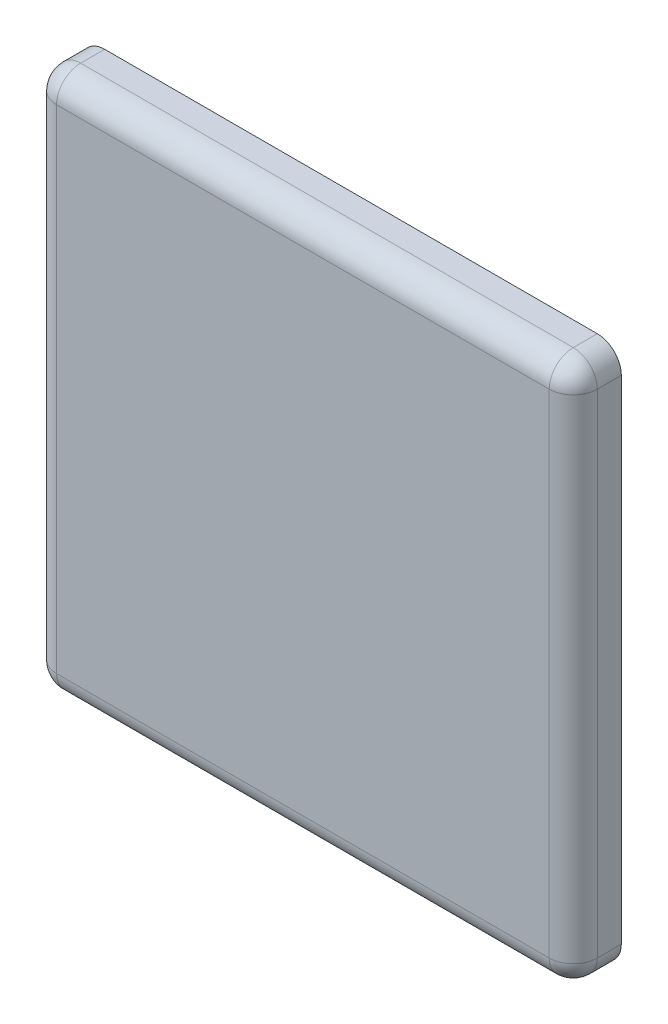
from build123d import *

# Parameters (mm, degrees)
ESQUISSE1_W          = 45
ESQUISSE1_H          = 45
BASE_EXTRUSION_DEPTH = 4
CONG_1_R             = 2


with BuildPart() as part:
    # Esquisse1 → Base-Extrusion (new body)
    with BuildSketch(Plane.XY):
        with Locations((22.5, 22.5)):
            Rectangle(ESQUISSE1_W, ESQUISSE1_H)
    extrude(amount=BASE_EXTRUSION_DEPTH)

    # Cong_1
    cong_1_edges = [part.edges().sort_by_distance(p)[0] for p in [
        (0, 0, 2),
        (45, 0, 2),
        (22.5, 0, 4),
        (45, 45, 2),
        (45, 22.5, 4),
        (0, 45, 2),
        (22.5, 45, 4),
        (0, 22.5, 4),
    ]]
    fillet(cong_1_edges, radius=CONG_1_R)


solid = part.part
